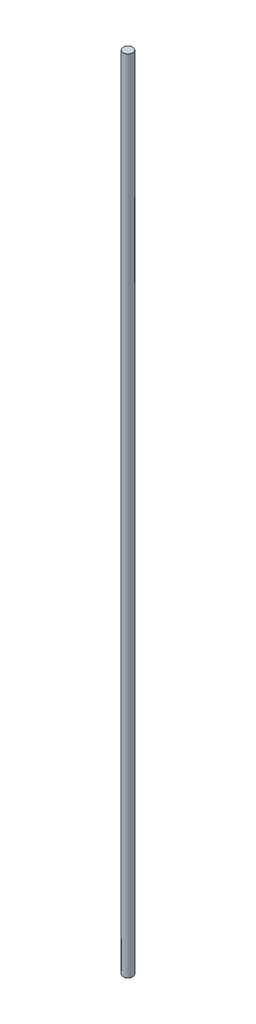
from build123d import *

# Parameters (mm, degrees)
SKETCH1_R           = 9.525
BOSS_EXTRUDE1_DEPTH = 1574.8


with BuildPart() as part:
    # Sketch1 → Boss-Extrude1 (new body)
    with BuildSketch(Plane(origin=(0, 0, 0), x_dir=(1, 0, 0), z_dir=(0, 1, 0))):
        with Locations(Location((0, 0, 0), (0, 0, 270))):
            Circle(SKETCH1_R)
    extrude(amount=BOSS_EXTRUDE1_DEPTH)


solid = part.part
